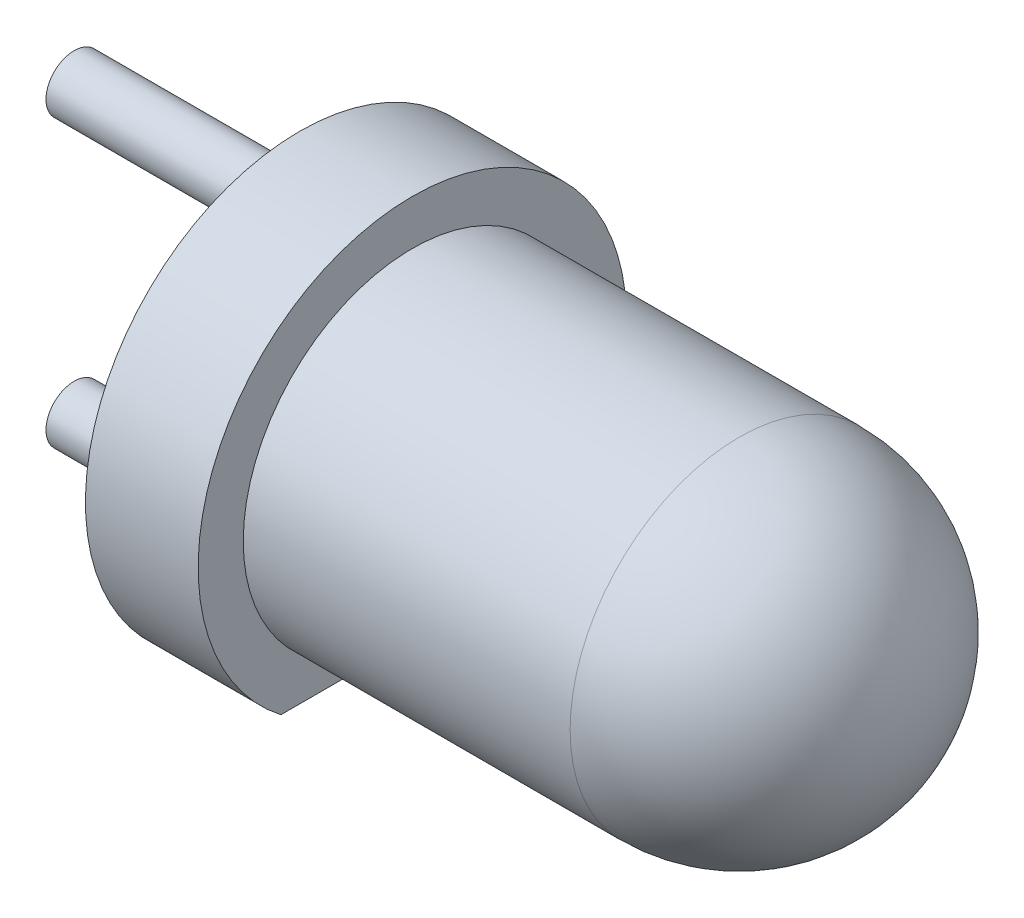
from build123d import *

# Parameters (mm, degrees)
ESQUISSE2_R             = 0.25
EXTRUSION1_DEPTH        = 2
ESQUISSE3_W             = 3.802685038
ESQUISSE3_H             = 0.717288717
ENL_V_MAT_EXTRU_1_DEPTH = 4


with BuildPart() as part:
    # Esquisse1 → R_volution1 (revolve)
    with BuildSketch(Plane.XY, mode=Mode.PRIVATE) as r_volution1_sk:
        with BuildLine():
            Line((0, 0), (4.4, 0))
            ThreePointArc((4.4, 0), (3.960660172, 1.060660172), (2.9, 1.5))
            Line((2.9, 1.5), (0, 1.5))
            Line((0, 1.5), (0, 1.9))
            Line((0, 1.9), (-1, 1.9))
            Line((-1, 1.9), (-1, 0))
            Line((-1, 0), (0, 0))
        make_face()
    revolve(r_volution1_sk.sketch.rotate(Axis((0, 0, 0), (1, 0, 0)), 90), axis=Axis((0, 0, 0), (1, 0, 0)))

    # Esquisse2 → Extrusion1 (add)
    with BuildSketch(Plane.ZY.offset(1)):
        with Locations(Location((0, 1.27, 0), (0, 0, 180))):
            Circle(ESQUISSE2_R)
        with Locations(Location((0, -1.27, 0), (0, 0, 180))):
            Circle(ESQUISSE2_R)
    extrude(amount=EXTRUSION1_DEPTH)

    # Esquisse3 → Enl_v. mat.-Extru.1 (cut)
    with BuildSketch(Plane.ZY.offset(1)):
        with Locations((0.034282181, -1.858644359)):
            Rectangle(ESQUISSE3_W, ESQUISSE3_H)
    extrude(amount=-ENL_V_MAT_EXTRU_1_DEPTH, mode=Mode.SUBTRACT)


solid = part.part
